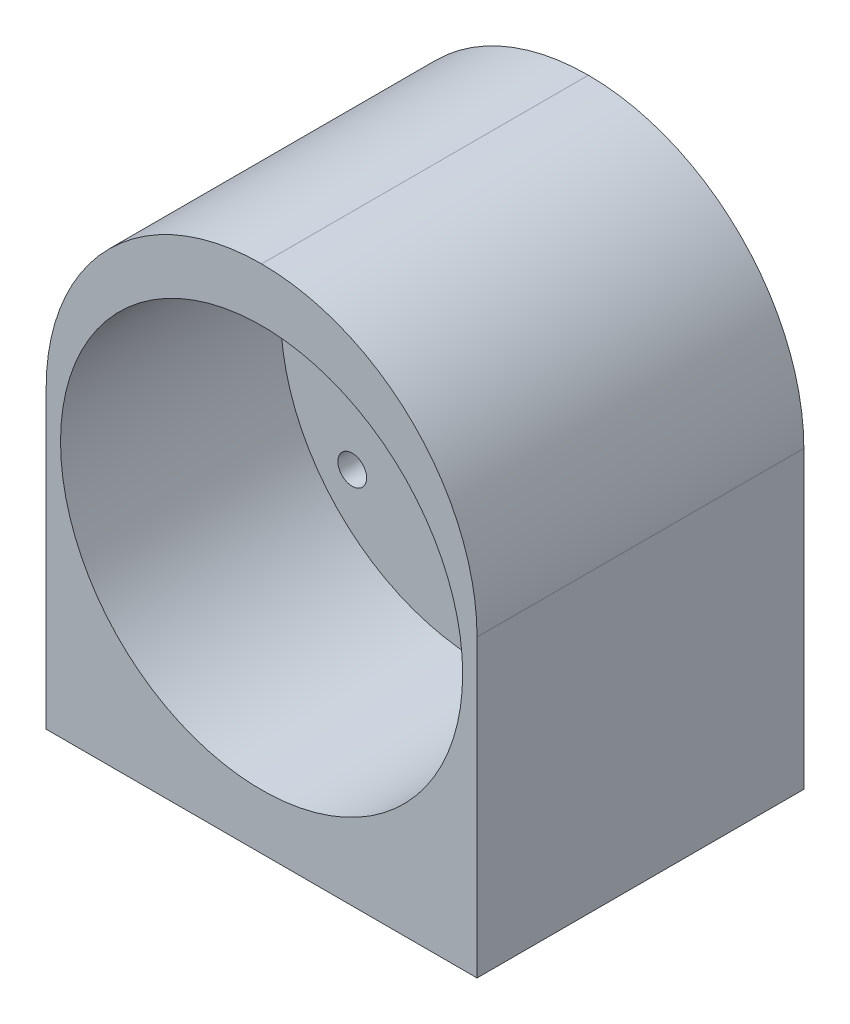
from build123d import *

# Parameters (mm, degrees)
SKETCH_1_W                = 45.003983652
SKETCH_1_H                = 34.132234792
EXTRUDE_2_DEPTH           = 53.34
CUT_EXTRUDE_2_DEPTH       = 22
CUT_EXTRUDE_2_DEPTH_BACK  = 1
SKETCH_16_R               = 21
SKETCH_26_R               = 1.5
CUT_EXTRUDE_3_DEPTH       = 13
FILLET_2_R                = 22.5
FILLET_4_R                = 22.5
SKETCH_28_R               = 1.5
CUT_EXTRUDE_4_DEPTH       = 10
CUT_EXTRUDE_13_DEPTH      = 1
CUT_EXTRUDE_13_DEPTH_BACK = 32
SKETCH_29_R               = 5


with BuildPart() as part:
    # Sketch 1 → Extrude 2 (new body)
    with BuildSketch(Plane(origin=(0, 0, 0), x_dir=(1, 0, 0), z_dir=(0, 1, 0))):
        with Locations((-9.7340077, -4.930211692)):
            Rectangle(SKETCH_1_W, SKETCH_1_H)
    extrude(amount=EXTRUDE_2_DEPTH)

    # Sketch 16 → Cut-Extrude 2 (cut, two sides: drawn at the far end of the back side and taken through both)
    with BuildSketch(Plane.XY.offset(-CUT_EXTRUDE_2_DEPTH_BACK)):
        with Locations((-9.7340077, 26.753562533)):
            Circle(SKETCH_16_R)
    extrude(amount=CUT_EXTRUDE_2_DEPTH + CUT_EXTRUDE_2_DEPTH_BACK, mode=Mode.SUBTRACT)

    # Sketch 26 → Cut-Extrude 3 (cut)
    with BuildSketch(Plane.XY):
        with Locations((3.795457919, 16.461969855)):
            Circle(SKETCH_26_R)
        with Locations((-23.263473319, 16.461969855)):
            Circle(SKETCH_26_R)
        with Locations((3.795457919, 37.045155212)):
            Circle(SKETCH_26_R)
        with Locations((-23.263473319, 37.045155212)):
            Circle(SKETCH_26_R)
    extrude(amount=-CUT_EXTRUDE_3_DEPTH, mode=Mode.SUBTRACT)

    # Fillet 2
    fillet_2_edges = [part.edges().sort_by_distance(p)[0] for p in [
        (-32.235999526, 53.34, 4.930211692),
    ]]
    fillet(fillet_2_edges, radius=FILLET_2_R)

    # Fillet 4
    fillet_4_edges = [part.edges().sort_by_distance(p)[0] for p in [
        (12.767984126, 53.34, 4.930211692),
    ]]
    fillet(fillet_4_edges, radius=FILLET_4_R)

    # Sketch 28 → Cut-Extrude 4 (cut)
    with BuildSketch(Plane(origin=(0, 0, 0), x_dir=(-1, 0, 0), z_dir=(0, -1, 0))):
        with Locations(Location((25.233771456, -12.982602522, 0), (0, 0, 90))):
            Circle(SKETCH_28_R)
        with Locations(Location((25.233771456, 3.14083949, 0), (0, 0, 90))):
            Circle(SKETCH_28_R)
        with Locations(Location((-5.767423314, 3.14083949, 0), (0, 0, 90))):
            Circle(SKETCH_28_R)
        with Locations(Location((-5.767423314, -12.982602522, 0), (0, 0, 90))):
            Circle(SKETCH_28_R)
    extrude(amount=-CUT_EXTRUDE_4_DEPTH, mode=Mode.SUBTRACT)

    # Sketch 29 → Cut-Extrude 13 (cut, two sides: drawn at the far end of the back side and taken through both)
    with BuildSketch(Plane.XY.offset(-CUT_EXTRUDE_13_DEPTH_BACK)):
        with Locations((-9.7340077, 26.753562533)):
            Circle(SKETCH_29_R)
    extrude(amount=CUT_EXTRUDE_13_DEPTH + CUT_EXTRUDE_13_DEPTH_BACK, mode=Mode.SUBTRACT)


solid = part.part
